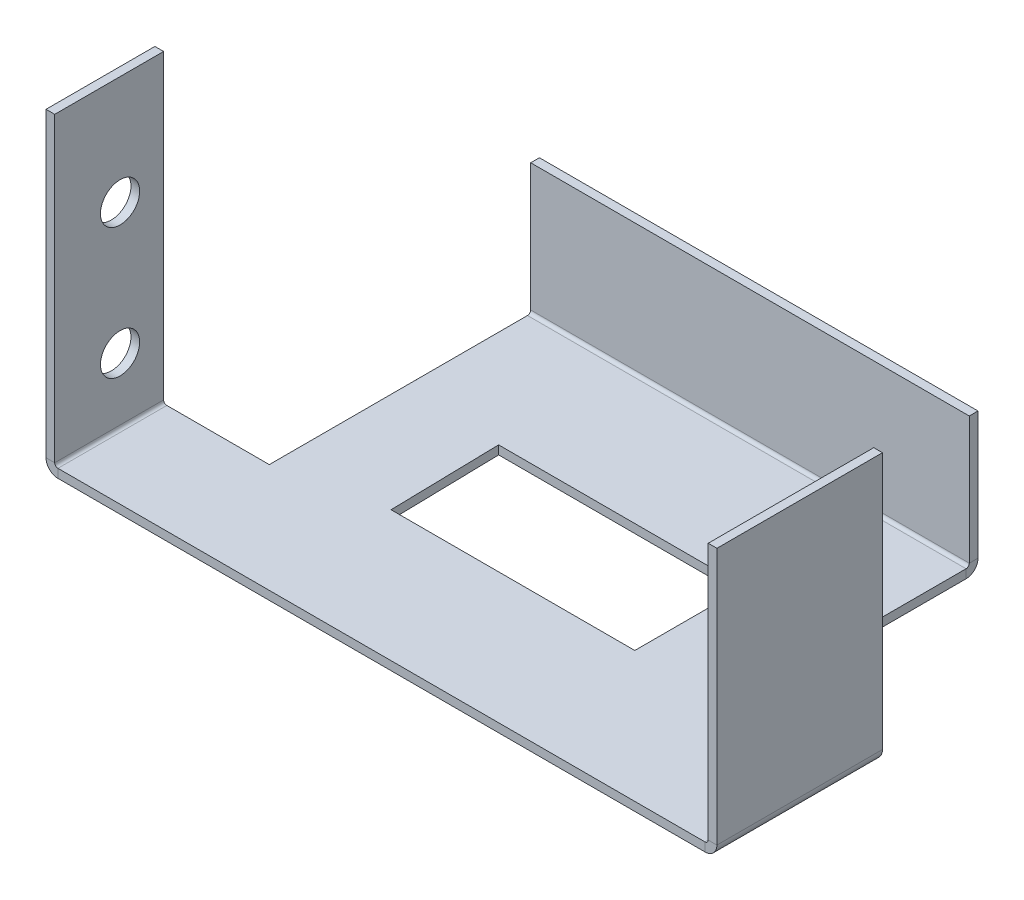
ISO-10303-21;
HEADER;
FILE_DESCRIPTION(('STEP AP214'),'2;1');
FILE_NAME('part.step','',(''),(''),'','','');
FILE_SCHEMA(('AUTOMOTIVE_DESIGN { 1 0 10303 214 1 1 1 1 }'));
ENDSEC;
DATA;
#1=APPLICATION_CONTEXT('core data for automotive mechanical design processes');
#2=APPLICATION_PROTOCOL_DEFINITION('international standard','automotive_design',2000,#1);
#3=PRODUCT_CONTEXT('',#1,'mechanical');
#4=PRODUCT('Part','Part','',(#3));
#5=PRODUCT_RELATED_PRODUCT_CATEGORY('part','',(#4));
#6=PRODUCT_DEFINITION_FORMATION('','',#4);
#7=PRODUCT_DEFINITION_CONTEXT('part definition',#1,'design');
#8=PRODUCT_DEFINITION('design','',#6,#7);
#9=PRODUCT_DEFINITION_SHAPE('','',#8);
#10=(LENGTH_UNIT() NAMED_UNIT(*) SI_UNIT(.MILLI.,.METRE.));
#11=(NAMED_UNIT(*) PLANE_ANGLE_UNIT() SI_UNIT($,.RADIAN.));
#12=(NAMED_UNIT(*) SI_UNIT($,.STERADIAN.) SOLID_ANGLE_UNIT());
#13=UNCERTAINTY_MEASURE_WITH_UNIT(LENGTH_MEASURE(1.E-05),#10,'distance_accuracy_value','');
#14=(GEOMETRIC_REPRESENTATION_CONTEXT(3) GLOBAL_UNCERTAINTY_ASSIGNED_CONTEXT((#13)) GLOBAL_UNIT_ASSIGNED_CONTEXT((#10,
#11,#12)) REPRESENTATION_CONTEXT('',''));
#15=CARTESIAN_POINT('',(0.,0.,0.));
#16=DIRECTION('',(0.,0.,1.));
#17=DIRECTION('',(1.,0.,0.));
#18=AXIS2_PLACEMENT_3D('',#15,#16,#17);
#19=CARTESIAN_POINT('',(-75.5051328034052,-2.,0.));
#20=DIRECTION('',(0.,1.,0.));
#21=DIRECTION('',(0.,0.,1.));
#22=AXIS2_PLACEMENT_3D('',#19,#20,#21);
#23=PLANE('',#22);
#24=DIRECTION('',(-1.,0.,0.));
#25=VECTOR('',#24,1.);
#26=CARTESIAN_POINT('',(-75.5051328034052,-2.,-55.2404705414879));
#27=LINE('',#26,#25);
#28=CARTESIAN_POINT('',(27.647227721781,-2.,-55.2404705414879));
#29=VERTEX_POINT('',#28);
#30=CARTESIAN_POINT('',(-28.8507209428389,-2.,-55.2404705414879));
#31=VERTEX_POINT('',#30);
#32=EDGE_CURVE('E227',#29,#31,#27,.T.);
#33=ORIENTED_EDGE('',*,*,#32,.T.);
#34=DIRECTION('',(0.0216638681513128,0.,0.999765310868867));
#35=VECTOR('',#34,1.);
#36=CARTESIAN_POINT('',(-27.6761755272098,-2.,-1.03640345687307));
#37=LINE('',#36,#35);
#38=CARTESIAN_POINT('',(-28.3037863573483,-2.,-30.));
#39=VERTEX_POINT('',#38);
#40=EDGE_CURVE('E230',#31,#39,#37,.T.);
#41=ORIENTED_EDGE('',*,*,#40,.T.);
#42=DIRECTION('',(1.,0.,0.));
#43=VECTOR('',#42,1.);
#44=CARTESIAN_POINT('',(-75.5051328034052,-2.,-30.));
#45=LINE('',#44,#43);
#46=CARTESIAN_POINT('',(27.647227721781,-2.,-30.));
#47=VERTEX_POINT('',#46);
#48=EDGE_CURVE('E222',#39,#47,#45,.T.);
#49=ORIENTED_EDGE('',*,*,#48,.T.);
#50=DIRECTION('',(0.,0.,-1.));
#51=VECTOR('',#50,1.);
#52=CARTESIAN_POINT('',(27.647227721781,-2.,0.));
#53=LINE('',#52,#51);
#54=EDGE_CURVE('E202',#47,#29,#53,.T.);
#55=ORIENTED_EDGE('',*,*,#54,.T.);
#56=EDGE_LOOP('',(#33,#41,#49,#55));
#57=FACE_BOUND('',#56,.T.);
#58=DIRECTION('',(0.,0.,1.));
#59=VECTOR('',#58,1.);
#60=CARTESIAN_POINT('',(-74.7685328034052,-2.,0.));
#61=LINE('',#60,#59);
#62=CARTESIAN_POINT('',(-74.7685328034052,-2.,0.));
#63=VERTEX_POINT('',#62);
#64=CARTESIAN_POINT('',(-74.7685328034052,-2.,-25.));
#65=VERTEX_POINT('',#64);
#66=EDGE_CURVE('E276',#63,#65,#61,.F.);
#67=ORIENTED_EDGE('',*,*,#66,.T.);
#68=DIRECTION('',(-1.,0.,0.));
#69=VECTOR('',#68,1.);
#70=CARTESIAN_POINT('',(-51.2495979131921,-2.,-25.));
#71=LINE('',#70,#69);
#72=CARTESIAN_POINT('',(-51.2495979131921,-2.,-25.));
#73=VERTEX_POINT('',#72);
#74=EDGE_CURVE('E416',#73,#65,#71,.T.);
#75=ORIENTED_EDGE('',*,*,#74,.F.);
#76=DIRECTION('',(0.,0.,1.));
#77=VECTOR('',#76,1.);
#78=CARTESIAN_POINT('',(-51.2495979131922,-2.,-85.));
#79=LINE('',#78,#77);
#80=CARTESIAN_POINT('',(-51.2495979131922,-2.00000000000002,-84.2633999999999));
#81=VERTEX_POINT('',#80);
#82=EDGE_CURVE('E414',#81,#73,#79,.T.);
#83=ORIENTED_EDGE('',*,*,#82,.F.);
#84=DIRECTION('',(-1.,0.,0.));
#85=VECTOR('',#84,1.);
#86=CARTESIAN_POINT('',(-51.2495979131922,-2.00000000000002,-84.2633999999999));
#87=LINE('',#86,#85);
#88=CARTESIAN_POINT('',(49.4239124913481,-2.,-84.2634));
#89=VERTEX_POINT('',#88);
#90=EDGE_CURVE('E383',#81,#89,#87,.F.);
#91=ORIENTED_EDGE('',*,*,#90,.T.);
#92=DIRECTION('',(0.,0.,-1.));
#93=VECTOR('',#92,1.);
#94=CARTESIAN_POINT('',(49.4239124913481,-2.,-38.));
#95=LINE('',#94,#93);
#96=CARTESIAN_POINT('',(49.4239124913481,-2.,-38.));
#97=VERTEX_POINT('',#96);
#98=EDGE_CURVE('E411',#97,#89,#95,.T.);
#99=ORIENTED_EDGE('',*,*,#98,.F.);
#100=DIRECTION('',(-1.,0.,0.));
#101=VECTOR('',#100,1.);
#102=CARTESIAN_POINT('',(74.4948671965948,-2.,-38.));
#103=LINE('',#102,#101);
#104=CARTESIAN_POINT('',(73.7582671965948,-2.,-38.));
#105=VERTEX_POINT('',#104);
#106=EDGE_CURVE('E408',#105,#97,#103,.T.);
#107=ORIENTED_EDGE('',*,*,#106,.F.);
#108=DIRECTION('',(0.,0.,-1.));
#109=VECTOR('',#108,1.);
#110=CARTESIAN_POINT('',(73.7582671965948,-2.,-38.));
#111=LINE('',#110,#109);
#112=CARTESIAN_POINT('',(73.7582671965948,-2.,0.));
#113=VERTEX_POINT('',#112);
#114=EDGE_CURVE('E329',#105,#113,#111,.F.);
#115=ORIENTED_EDGE('',*,*,#114,.T.);
#116=DIRECTION('',(1.,0.,0.));
#117=VECTOR('',#116,1.);
#118=CARTESIAN_POINT('',(-75.5051328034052,-2.,0.));
#119=LINE('',#118,#117);
#120=EDGE_CURVE('E406',#63,#113,#119,.T.);
#121=ORIENTED_EDGE('',*,*,#120,.F.);
#122=EDGE_LOOP('',(#67,#75,#83,#91,#99,#107,#115,#121));
#123=FACE_BOUND('',#122,.T.);
#124=ADVANCED_FACE('F35',(#57,#123),#23,.F.);
#125=CARTESIAN_POINT('',(-75.5051328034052,0.,0.));
#126=DIRECTION('',(0.,1.,0.));
#127=DIRECTION('',(0.,0.,1.));
#128=AXIS2_PLACEMENT_3D('',#125,#126,#127);
#129=PLANE('',#128);
#130=DIRECTION('',(0.0216638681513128,0.,0.999765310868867));
#131=VECTOR('',#130,1.);
#132=CARTESIAN_POINT('',(-28.8507209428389,0.,-55.2404705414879));
#133=LINE('',#132,#131);
#134=CARTESIAN_POINT('',(-28.8507209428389,0.,-55.2404705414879));
#135=VERTEX_POINT('',#134);
#136=CARTESIAN_POINT('',(-28.3037863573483,0.,-30.));
#137=VERTEX_POINT('',#136);
#138=EDGE_CURVE('E58',#135,#137,#133,.T.);
#139=ORIENTED_EDGE('',*,*,#138,.F.);
#140=DIRECTION('',(-1.,0.,0.));
#141=VECTOR('',#140,1.);
#142=CARTESIAN_POINT('',(-28.8507209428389,0.,-55.2404705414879));
#143=LINE('',#142,#141);
#144=CARTESIAN_POINT('',(27.647227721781,0.,-55.2404705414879));
#145=VERTEX_POINT('',#144);
#146=EDGE_CURVE('E215',#145,#135,#143,.T.);
#147=ORIENTED_EDGE('',*,*,#146,.F.);
#148=DIRECTION('',(0.,0.,-1.));
#149=VECTOR('',#148,1.);
#150=CARTESIAN_POINT('',(27.647227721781,0.,-55.2404705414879));
#151=LINE('',#150,#149);
#152=CARTESIAN_POINT('',(27.647227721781,0.,-30.));
#153=VERTEX_POINT('',#152);
#154=EDGE_CURVE('E199',#153,#145,#151,.T.);
#155=ORIENTED_EDGE('',*,*,#154,.F.);
#156=DIRECTION('',(1.,0.,0.));
#157=VECTOR('',#156,1.);
#158=CARTESIAN_POINT('',(-28.3037863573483,0.,-30.));
#159=LINE('',#158,#157);
#160=EDGE_CURVE('E208',#137,#153,#159,.T.);
#161=ORIENTED_EDGE('',*,*,#160,.F.);
#162=EDGE_LOOP('',(#139,#147,#155,#161));
#163=FACE_BOUND('',#162,.T.);
#164=DIRECTION('',(-1.,0.,0.));
#165=VECTOR('',#164,1.);
#166=CARTESIAN_POINT('',(-51.2495979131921,0.,-25.));
#167=LINE('',#166,#165);
#168=CARTESIAN_POINT('',(-51.2495979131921,0.,-25.));
#169=VERTEX_POINT('',#168);
#170=CARTESIAN_POINT('',(-74.7685328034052,0.,-25.));
#171=VERTEX_POINT('',#170);
#172=EDGE_CURVE('E409',#169,#171,#167,.T.);
#173=ORIENTED_EDGE('',*,*,#172,.T.);
#174=DIRECTION('',(0.,0.,1.));
#175=VECTOR('',#174,1.);
#176=CARTESIAN_POINT('',(-74.7685328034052,0.,0.));
#177=LINE('',#176,#175);
#178=CARTESIAN_POINT('',(-74.7685328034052,0.,0.));
#179=VERTEX_POINT('',#178);
#180=EDGE_CURVE('E288',#179,#171,#177,.F.);
#181=ORIENTED_EDGE('',*,*,#180,.F.);
#182=DIRECTION('',(1.,0.,0.));
#183=VECTOR('',#182,1.);
#184=CARTESIAN_POINT('',(-75.5051328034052,0.,0.));
#185=LINE('',#184,#183);
#186=CARTESIAN_POINT('',(73.7582671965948,0.,0.));
#187=VERTEX_POINT('',#186);
#188=EDGE_CURVE('E403',#179,#187,#185,.T.);
#189=ORIENTED_EDGE('',*,*,#188,.T.);
#190=DIRECTION('',(0.,0.,-1.));
#191=VECTOR('',#190,1.);
#192=CARTESIAN_POINT('',(73.7582671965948,0.,-38.));
#193=LINE('',#192,#191);
#194=CARTESIAN_POINT('',(73.7582671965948,0.,-38.));
#195=VERTEX_POINT('',#194);
#196=EDGE_CURVE('E342',#195,#187,#193,.F.);
#197=ORIENTED_EDGE('',*,*,#196,.F.);
#198=DIRECTION('',(-1.,0.,0.));
#199=VECTOR('',#198,1.);
#200=CARTESIAN_POINT('',(74.4948671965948,0.,-38.));
#201=LINE('',#200,#199);
#202=CARTESIAN_POINT('',(49.4239124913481,0.,-38.));
#203=VERTEX_POINT('',#202);
#204=EDGE_CURVE('E420',#195,#203,#201,.T.);
#205=ORIENTED_EDGE('',*,*,#204,.T.);
#206=DIRECTION('',(0.,0.,-1.));
#207=VECTOR('',#206,1.);
#208=CARTESIAN_POINT('',(49.4239124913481,0.,-38.));
#209=LINE('',#208,#207);
#210=CARTESIAN_POINT('',(49.4239124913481,0.,-84.2634));
#211=VERTEX_POINT('',#210);
#212=EDGE_CURVE('E422',#203,#211,#209,.T.);
#213=ORIENTED_EDGE('',*,*,#212,.T.);
#214=DIRECTION('',(-1.,0.,0.));
#215=VECTOR('',#214,1.);
#216=CARTESIAN_POINT('',(-51.2495979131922,0.,-84.2634));
#217=LINE('',#216,#215);
#218=CARTESIAN_POINT('',(-51.2495979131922,0.,-84.2634));
#219=VERTEX_POINT('',#218);
#220=EDGE_CURVE('E395',#219,#211,#217,.F.);
#221=ORIENTED_EDGE('',*,*,#220,.F.);
#222=DIRECTION('',(0.,0.,1.));
#223=VECTOR('',#222,1.);
#224=CARTESIAN_POINT('',(-51.2495979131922,0.,-85.));
#225=LINE('',#224,#223);
#226=EDGE_CURVE('E425',#219,#169,#225,.T.);
#227=ORIENTED_EDGE('',*,*,#226,.T.);
#228=EDGE_LOOP('',(#173,#181,#189,#197,#205,#213,#221,#227));
#229=FACE_BOUND('',#228,.T.);
#230=ADVANCED_FACE('F212',(#163,#229),#129,.T.);
#231=CARTESIAN_POINT('',(-75.5051328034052,-2.,0.));
#232=DIRECTION('',(0.,0.,1.));
#233=DIRECTION('',(1.,0.,0.));
#234=AXIS2_PLACEMENT_3D('',#231,#232,#233);
#235=PLANE('',#234);
#236=ORIENTED_EDGE('',*,*,#188,.F.);
#237=DIRECTION('',(0.,-1.,0.));
#238=VECTOR('',#237,1.);
#239=CARTESIAN_POINT('',(-74.7685328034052,0.,0.));
#240=LINE('',#239,#238);
#241=EDGE_CURVE('E282',#179,#63,#240,.T.);
#242=ORIENTED_EDGE('',*,*,#241,.T.);
#243=ORIENTED_EDGE('',*,*,#120,.T.);
#244=DIRECTION('',(0.,-1.,0.));
#245=VECTOR('',#244,1.);
#246=CARTESIAN_POINT('',(73.7582671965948,0.,0.));
#247=LINE('',#246,#245);
#248=EDGE_CURVE('E347',#187,#113,#247,.T.);
#249=ORIENTED_EDGE('',*,*,#248,.F.);
#250=EDGE_LOOP('',(#236,#242,#243,#249));
#251=FACE_BOUND('',#250,.T.);
#252=ADVANCED_FACE('F37',(#251),#235,.T.);
#253=CARTESIAN_POINT('',(74.4948671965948,-2.,-38.));
#254=DIRECTION('',(0.,0.,-1.));
#255=DIRECTION('',(-1.,0.,0.));
#256=AXIS2_PLACEMENT_3D('',#253,#254,#255);
#257=PLANE('',#256);
#258=ORIENTED_EDGE('',*,*,#204,.F.);
#259=DIRECTION('',(0.,-1.,0.));
#260=VECTOR('',#259,1.);
#261=CARTESIAN_POINT('',(73.7582671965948,0.,-38.));
#262=LINE('',#261,#260);
#263=EDGE_CURVE('E336',#195,#105,#262,.T.);
#264=ORIENTED_EDGE('',*,*,#263,.T.);
#265=ORIENTED_EDGE('',*,*,#106,.T.);
#266=DIRECTION('',(0.,1.,0.));
#267=VECTOR('',#266,1.);
#268=CARTESIAN_POINT('',(49.4239124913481,-2.,-38.));
#269=LINE('',#268,#267);
#270=EDGE_CURVE('E39',#97,#203,#269,.T.);
#271=ORIENTED_EDGE('',*,*,#270,.T.);
#272=EDGE_LOOP('',(#258,#264,#265,#271));
#273=FACE_BOUND('',#272,.T.);
#274=ADVANCED_FACE('F493',(#273),#257,.T.);
#275=CARTESIAN_POINT('',(-51.2495979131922,-2.,-85.));
#276=DIRECTION('',(-1.,0.,0.));
#277=DIRECTION('',(0.,0.,1.));
#278=AXIS2_PLACEMENT_3D('',#275,#276,#277);
#279=PLANE('',#278);
#280=ORIENTED_EDGE('',*,*,#226,.F.);
#281=DIRECTION('',(0.,-1.,0.));
#282=VECTOR('',#281,1.);
#283=CARTESIAN_POINT('',(-51.2495979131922,0.,-84.2634));
#284=LINE('',#283,#282);
#285=EDGE_CURVE('E389',#219,#81,#284,.T.);
#286=ORIENTED_EDGE('',*,*,#285,.T.);
#287=ORIENTED_EDGE('',*,*,#82,.T.);
#288=DIRECTION('',(0.,1.,0.));
#289=VECTOR('',#288,1.);
#290=CARTESIAN_POINT('',(-51.2495979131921,-2.,-25.));
#291=LINE('',#290,#289);
#292=EDGE_CURVE('E11',#73,#169,#291,.T.);
#293=ORIENTED_EDGE('',*,*,#292,.T.);
#294=EDGE_LOOP('',(#280,#286,#287,#293));
#295=FACE_BOUND('',#294,.T.);
#296=ADVANCED_FACE('F490',(#295),#279,.T.);
#297=CARTESIAN_POINT('',(-51.2495979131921,-2.,-25.));
#298=DIRECTION('',(0.,0.,-1.));
#299=DIRECTION('',(-1.,0.,0.));
#300=AXIS2_PLACEMENT_3D('',#297,#298,#299);
#301=PLANE('',#300);
#302=DIRECTION('',(0.,-1.,0.));
#303=VECTOR('',#302,1.);
#304=CARTESIAN_POINT('',(-74.7685328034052,0.,-25.));
#305=LINE('',#304,#303);
#306=EDGE_CURVE('E293',#171,#65,#305,.T.);
#307=ORIENTED_EDGE('',*,*,#306,.F.);
#308=ORIENTED_EDGE('',*,*,#172,.F.);
#309=ORIENTED_EDGE('',*,*,#292,.F.);
#310=ORIENTED_EDGE('',*,*,#74,.T.);
#311=EDGE_LOOP('',(#307,#308,#309,#310));
#312=FACE_BOUND('',#311,.T.);
#313=ADVANCED_FACE('F486',(#312),#301,.T.);
#314=CARTESIAN_POINT('',(49.4239124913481,-2.,-38.));
#315=DIRECTION('',(1.,0.,0.));
#316=DIRECTION('',(0.,0.,-1.));
#317=AXIS2_PLACEMENT_3D('',#314,#315,#316);
#318=PLANE('',#317);
#319=DIRECTION('',(0.,-1.,0.));
#320=VECTOR('',#319,1.);
#321=CARTESIAN_POINT('',(49.4239124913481,0.,-84.2634));
#322=LINE('',#321,#320);
#323=EDGE_CURVE('E400',#211,#89,#322,.T.);
#324=ORIENTED_EDGE('',*,*,#323,.F.);
#325=ORIENTED_EDGE('',*,*,#212,.F.);
#326=ORIENTED_EDGE('',*,*,#270,.F.);
#327=ORIENTED_EDGE('',*,*,#98,.T.);
#328=EDGE_LOOP('',(#324,#325,#326,#327));
#329=FACE_BOUND('',#328,.T.);
#330=ADVANCED_FACE('F489',(#329),#318,.T.);
#331=CARTESIAN_POINT('',(49.4239124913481,0.736599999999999,-84.2634));
#332=DIRECTION('',(1.,0.,0.));
#333=DIRECTION('',(0.,0.,-1.));
#334=AXIS2_PLACEMENT_3D('',#331,#332,#333);
#335=PLANE('',#334);
#336=DIRECTION('',(0.,0.,-1.));
#337=VECTOR('',#336,1.);
#338=CARTESIAN_POINT('',(49.4239124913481,0.736600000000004,-85.));
#339=LINE('',#338,#337);
#340=CARTESIAN_POINT('',(49.4239124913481,0.736599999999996,-85.));
#341=VERTEX_POINT('',#340);
#342=CARTESIAN_POINT('',(49.4239124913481,0.736599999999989,-87.));
#343=VERTEX_POINT('',#342);
#344=EDGE_CURVE('E350',#341,#343,#339,.T.);
#345=ORIENTED_EDGE('',*,*,#344,.F.);
#346=CARTESIAN_POINT('',(49.4239124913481,0.736599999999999,-84.2634));
#347=DIRECTION('',(-1.,0.,0.));
#348=DIRECTION('',(0.,0.,1.));
#349=AXIS2_PLACEMENT_3D('',#346,#347,#348);
#350=CIRCLE('',#349,0.736600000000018);
#351=EDGE_CURVE('E392',#211,#341,#350,.F.);
#352=ORIENTED_EDGE('',*,*,#351,.F.);
#353=ORIENTED_EDGE('',*,*,#323,.T.);
#354=CARTESIAN_POINT('',(49.4239124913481,0.736599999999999,-84.2634));
#355=DIRECTION('',(-1.,0.,0.));
#356=DIRECTION('',(0.,0.,1.));
#357=AXIS2_PLACEMENT_3D('',#354,#355,#356);
#358=CIRCLE('',#357,2.73660000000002);
#359=EDGE_CURVE('E385',#89,#343,#358,.F.);
#360=ORIENTED_EDGE('',*,*,#359,.T.);
#361=EDGE_LOOP('',(#345,#352,#353,#360));
#362=FACE_BOUND('',#361,.T.);
#363=ADVANCED_FACE('F496',(#362),#335,.T.);
#364=CARTESIAN_POINT('',(-51.2495979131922,0.736599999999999,-84.2634));
#365=DIRECTION('',(1.,0.,0.));
#366=DIRECTION('',(0.,0.,-1.));
#367=AXIS2_PLACEMENT_3D('',#364,#365,#366);
#368=PLANE('',#367);
#369=CARTESIAN_POINT('',(-51.2495979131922,0.736599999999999,-84.2634));
#370=DIRECTION('',(-1.,0.,0.));
#371=DIRECTION('',(0.,0.,1.));
#372=AXIS2_PLACEMENT_3D('',#369,#370,#371);
#373=CIRCLE('',#372,0.736600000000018);
#374=CARTESIAN_POINT('',(-51.2495979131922,0.736599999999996,-85.));
#375=VERTEX_POINT('',#374);
#376=EDGE_CURVE('E382',#375,#219,#373,.T.);
#377=ORIENTED_EDGE('',*,*,#376,.F.);
#378=DIRECTION('',(0.,0.,-1.));
#379=VECTOR('',#378,1.);
#380=CARTESIAN_POINT('',(-51.2495979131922,0.736600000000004,-85.));
#381=LINE('',#380,#379);
#382=CARTESIAN_POINT('',(-51.2495979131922,0.736600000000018,-87.));
#383=VERTEX_POINT('',#382);
#384=EDGE_CURVE('E355',#375,#383,#381,.T.);
#385=ORIENTED_EDGE('',*,*,#384,.T.);
#386=CARTESIAN_POINT('',(-51.2495979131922,0.736599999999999,-84.2634));
#387=DIRECTION('',(-1.,0.,0.));
#388=DIRECTION('',(0.,0.,1.));
#389=AXIS2_PLACEMENT_3D('',#386,#387,#388);
#390=CIRCLE('',#389,2.73660000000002);
#391=EDGE_CURVE('E386',#383,#81,#390,.T.);
#392=ORIENTED_EDGE('',*,*,#391,.T.);
#393=ORIENTED_EDGE('',*,*,#285,.F.);
#394=EDGE_LOOP('',(#377,#385,#392,#393));
#395=FACE_BOUND('',#394,.T.);
#396=ADVANCED_FACE('F483',(#395),#368,.F.);
#397=CARTESIAN_POINT('',(-51.2495979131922,0.736599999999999,-84.2634));
#398=DIRECTION('',(-1.,0.,0.));
#399=DIRECTION('',(0.,0.,-1.));
#400=AXIS2_PLACEMENT_3D('',#397,#398,#399);
#401=CYLINDRICAL_SURFACE('',#400,2.73660000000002);
#402=ORIENTED_EDGE('',*,*,#90,.F.);
#403=ORIENTED_EDGE('',*,*,#391,.F.);
#404=DIRECTION('',(1.,0.,0.));
#405=VECTOR('',#404,1.);
#406=CARTESIAN_POINT('',(-51.2495979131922,0.736600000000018,-87.));
#407=LINE('',#406,#405);
#408=EDGE_CURVE('E358',#383,#343,#407,.T.);
#409=ORIENTED_EDGE('',*,*,#408,.T.);
#410=ORIENTED_EDGE('',*,*,#359,.F.);
#411=EDGE_LOOP('',(#402,#403,#409,#410));
#412=FACE_BOUND('',#411,.T.);
#413=ADVANCED_FACE('F581',(#412),#401,.T.);
#414=CARTESIAN_POINT('',(-51.2495979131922,0.736599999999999,-84.2634));
#415=DIRECTION('',(-1.,0.,0.));
#416=DIRECTION('',(0.,0.,-1.));
#417=AXIS2_PLACEMENT_3D('',#414,#415,#416);
#418=CYLINDRICAL_SURFACE('',#417,0.736600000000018);
#419=ORIENTED_EDGE('',*,*,#220,.T.);
#420=ORIENTED_EDGE('',*,*,#351,.T.);
#421=DIRECTION('',(-1.,0.,0.));
#422=VECTOR('',#421,1.);
#423=CARTESIAN_POINT('',(49.4239124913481,0.736600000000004,-85.));
#424=LINE('',#423,#422);
#425=EDGE_CURVE('E353',#341,#375,#424,.T.);
#426=ORIENTED_EDGE('',*,*,#425,.T.);
#427=ORIENTED_EDGE('',*,*,#376,.T.);
#428=EDGE_LOOP('',(#419,#420,#426,#427));
#429=FACE_BOUND('',#428,.T.);
#430=ADVANCED_FACE('F547',(#429),#418,.F.);
#431=CARTESIAN_POINT('',(-51.2495979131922,30.,-87.0000000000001));
#432=DIRECTION('',(1.,0.,0.));
#433=DIRECTION('',(0.,0.,-1.));
#434=AXIS2_PLACEMENT_3D('',#431,#432,#433);
#435=PLANE('',#434);
#436=ORIENTED_EDGE('',*,*,#384,.F.);
#437=DIRECTION('',(0.,1.,0.));
#438=VECTOR('',#437,1.);
#439=CARTESIAN_POINT('',(-51.2495979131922,30.,-85.0000000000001));
#440=LINE('',#439,#438);
#441=CARTESIAN_POINT('',(-51.2495979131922,30.,-85.0000000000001));
#442=VERTEX_POINT('',#441);
#443=EDGE_CURVE('E362',#375,#442,#440,.T.);
#444=ORIENTED_EDGE('',*,*,#443,.T.);
#445=DIRECTION('',(0.,0.,1.));
#446=VECTOR('',#445,1.);
#447=CARTESIAN_POINT('',(-51.2495979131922,30.,-87.0000000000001));
#448=LINE('',#447,#446);
#449=CARTESIAN_POINT('',(-51.2495979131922,30.,-87.0000000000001));
#450=VERTEX_POINT('',#449);
#451=EDGE_CURVE('E379',#450,#442,#448,.T.);
#452=ORIENTED_EDGE('',*,*,#451,.F.);
#453=DIRECTION('',(0.,1.,0.));
#454=VECTOR('',#453,1.);
#455=CARTESIAN_POINT('',(-51.2495979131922,30.,-87.0000000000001));
#456=LINE('',#455,#454);
#457=EDGE_CURVE('E363',#383,#450,#456,.T.);
#458=ORIENTED_EDGE('',*,*,#457,.F.);
#459=EDGE_LOOP('',(#436,#444,#452,#458));
#460=FACE_BOUND('',#459,.T.);
#461=ADVANCED_FACE('F573',(#460),#435,.F.);
#462=CARTESIAN_POINT('',(49.4239124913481,0.,-87.));
#463=DIRECTION('',(-1.,0.,0.));
#464=DIRECTION('',(0.,-1.,0.));
#465=AXIS2_PLACEMENT_3D('',#462,#463,#464);
#466=PLANE('',#465);
#467=ORIENTED_EDGE('',*,*,#344,.T.);
#468=DIRECTION('',(0.,-1.,0.));
#469=VECTOR('',#468,1.);
#470=CARTESIAN_POINT('',(49.4239124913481,0.,-87.));
#471=LINE('',#470,#469);
#472=CARTESIAN_POINT('',(49.4239124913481,30.,-87.0000000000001));
#473=VERTEX_POINT('',#472);
#474=EDGE_CURVE('E368',#473,#343,#471,.T.);
#475=ORIENTED_EDGE('',*,*,#474,.F.);
#476=DIRECTION('',(0.,0.,1.));
#477=VECTOR('',#476,1.);
#478=CARTESIAN_POINT('',(49.4239124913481,30.,-87.0000000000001));
#479=LINE('',#478,#477);
#480=CARTESIAN_POINT('',(49.4239124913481,30.,-85.0000000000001));
#481=VERTEX_POINT('',#480);
#482=EDGE_CURVE('E371',#473,#481,#479,.T.);
#483=ORIENTED_EDGE('',*,*,#482,.T.);
#484=DIRECTION('',(0.,-1.,0.));
#485=VECTOR('',#484,1.);
#486=CARTESIAN_POINT('',(49.4239124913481,0.,-85.));
#487=LINE('',#486,#485);
#488=EDGE_CURVE('E366',#481,#341,#487,.T.);
#489=ORIENTED_EDGE('',*,*,#488,.T.);
#490=EDGE_LOOP('',(#467,#475,#483,#489));
#491=FACE_BOUND('',#490,.T.);
#492=ADVANCED_FACE('F554',(#491),#466,.F.);
#493=CARTESIAN_POINT('',(-51.2495979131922,0.,-87.));
#494=DIRECTION('',(0.,0.,1.));
#495=DIRECTION('',(0.,-1.,0.));
#496=AXIS2_PLACEMENT_3D('',#493,#494,#495);
#497=PLANE('',#496);
#498=ORIENTED_EDGE('',*,*,#408,.F.);
#499=ORIENTED_EDGE('',*,*,#457,.T.);
#500=DIRECTION('',(1.,0.,0.));
#501=VECTOR('',#500,1.);
#502=CARTESIAN_POINT('',(49.4239124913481,30.,-87.0000000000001));
#503=LINE('',#502,#501);
#504=EDGE_CURVE('E365',#450,#473,#503,.T.);
#505=ORIENTED_EDGE('',*,*,#504,.T.);
#506=ORIENTED_EDGE('',*,*,#474,.T.);
#507=EDGE_LOOP('',(#498,#499,#505,#506));
#508=FACE_BOUND('',#507,.T.);
#509=ADVANCED_FACE('F558',(#508),#497,.F.);
#510=CARTESIAN_POINT('',(-51.2495979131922,0.,-85.));
#511=DIRECTION('',(0.,0.,1.));
#512=DIRECTION('',(0.,-1.,0.));
#513=AXIS2_PLACEMENT_3D('',#510,#511,#512);
#514=PLANE('',#513);
#515=ORIENTED_EDGE('',*,*,#443,.F.);
#516=ORIENTED_EDGE('',*,*,#425,.F.);
#517=ORIENTED_EDGE('',*,*,#488,.F.);
#518=DIRECTION('',(1.,0.,0.));
#519=VECTOR('',#518,1.);
#520=CARTESIAN_POINT('',(49.4239124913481,30.,-85.0000000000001));
#521=LINE('',#520,#519);
#522=EDGE_CURVE('E373',#442,#481,#521,.T.);
#523=ORIENTED_EDGE('',*,*,#522,.F.);
#524=EDGE_LOOP('',(#515,#516,#517,#523));
#525=FACE_BOUND('',#524,.T.);
#526=ADVANCED_FACE('F568',(#525),#514,.T.);
#527=CARTESIAN_POINT('',(49.4239124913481,30.,-87.0000000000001));
#528=DIRECTION('',(0.,-1.,0.));
#529=DIRECTION('',(0.,0.,-1.));
#530=AXIS2_PLACEMENT_3D('',#527,#528,#529);
#531=PLANE('',#530);
#532=ORIENTED_EDGE('',*,*,#522,.T.);
#533=ORIENTED_EDGE('',*,*,#482,.F.);
#534=ORIENTED_EDGE('',*,*,#504,.F.);
#535=ORIENTED_EDGE('',*,*,#451,.T.);
#536=EDGE_LOOP('',(#532,#533,#534,#535));
#537=FACE_BOUND('',#536,.T.);
#538=ADVANCED_FACE('F564',(#537),#531,.F.);
#539=CARTESIAN_POINT('',(73.7582671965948,0.736600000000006,0.));
#540=DIRECTION('',(0.,0.,1.));
#541=DIRECTION('',(1.,0.,0.));
#542=AXIS2_PLACEMENT_3D('',#539,#540,#541);
#543=PLANE('',#542);
#544=DIRECTION('',(1.,0.,0.));
#545=VECTOR('',#544,1.);
#546=CARTESIAN_POINT('',(74.4948671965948,0.736600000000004,0.));
#547=LINE('',#546,#545);
#548=CARTESIAN_POINT('',(74.4948671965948,0.736600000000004,0.));
#549=VERTEX_POINT('',#548);
#550=CARTESIAN_POINT('',(76.4948671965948,0.736599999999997,0.));
#551=VERTEX_POINT('',#550);
#552=EDGE_CURVE('E296',#549,#551,#547,.T.);
#553=ORIENTED_EDGE('',*,*,#552,.F.);
#554=CARTESIAN_POINT('',(73.7582671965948,0.736600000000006,0.));
#555=DIRECTION('',(0.,0.,-1.));
#556=DIRECTION('',(-1.,0.,0.));
#557=AXIS2_PLACEMENT_3D('',#554,#555,#556);
#558=CIRCLE('',#557,0.736600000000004);
#559=EDGE_CURVE('E339',#187,#549,#558,.F.);
#560=ORIENTED_EDGE('',*,*,#559,.F.);
#561=ORIENTED_EDGE('',*,*,#248,.T.);
#562=CARTESIAN_POINT('',(73.7582671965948,0.736600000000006,0.));
#563=DIRECTION('',(0.,0.,-1.));
#564=DIRECTION('',(-1.,0.,0.));
#565=AXIS2_PLACEMENT_3D('',#562,#563,#564);
#566=CIRCLE('',#565,2.7366);
#567=EDGE_CURVE('E332',#113,#551,#566,.F.);
#568=ORIENTED_EDGE('',*,*,#567,.T.);
#569=EDGE_LOOP('',(#553,#560,#561,#568));
#570=FACE_BOUND('',#569,.T.);
#571=ADVANCED_FACE('F541',(#570),#543,.T.);
#572=CARTESIAN_POINT('',(73.7582671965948,0.736600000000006,-38.));
#573=DIRECTION('',(0.,0.,1.));
#574=DIRECTION('',(1.,0.,0.));
#575=AXIS2_PLACEMENT_3D('',#572,#573,#574);
#576=PLANE('',#575);
#577=CARTESIAN_POINT('',(73.7582671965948,0.736600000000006,-38.));
#578=DIRECTION('',(0.,0.,-1.));
#579=DIRECTION('',(-1.,0.,0.));
#580=AXIS2_PLACEMENT_3D('',#577,#578,#579);
#581=CIRCLE('',#580,0.736600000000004);
#582=CARTESIAN_POINT('',(74.4948671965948,0.736600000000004,-38.));
#583=VERTEX_POINT('',#582);
#584=EDGE_CURVE('E328',#583,#195,#581,.T.);
#585=ORIENTED_EDGE('',*,*,#584,.F.);
#586=DIRECTION('',(1.,0.,0.));
#587=VECTOR('',#586,1.);
#588=CARTESIAN_POINT('',(74.4948671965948,0.736600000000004,-38.));
#589=LINE('',#588,#587);
#590=CARTESIAN_POINT('',(76.4948671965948,0.736599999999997,-38.));
#591=VERTEX_POINT('',#590);
#592=EDGE_CURVE('E301',#583,#591,#589,.T.);
#593=ORIENTED_EDGE('',*,*,#592,.T.);
#594=CARTESIAN_POINT('',(73.7582671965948,0.736600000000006,-38.));
#595=DIRECTION('',(0.,0.,-1.));
#596=DIRECTION('',(-1.,0.,0.));
#597=AXIS2_PLACEMENT_3D('',#594,#595,#596);
#598=CIRCLE('',#597,2.7366);
#599=EDGE_CURVE('E333',#591,#105,#598,.T.);
#600=ORIENTED_EDGE('',*,*,#599,.T.);
#601=ORIENTED_EDGE('',*,*,#263,.F.);
#602=EDGE_LOOP('',(#585,#593,#600,#601));
#603=FACE_BOUND('',#602,.T.);
#604=ADVANCED_FACE('F512',(#603),#576,.F.);
#605=CARTESIAN_POINT('',(73.7582671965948,0.736600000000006,-38.));
#606=DIRECTION('',(0.,0.,-1.));
#607=DIRECTION('',(1.,0.,0.));
#608=AXIS2_PLACEMENT_3D('',#605,#606,#607);
#609=CYLINDRICAL_SURFACE('',#608,2.7366);
#610=ORIENTED_EDGE('',*,*,#114,.F.);
#611=ORIENTED_EDGE('',*,*,#599,.F.);
#612=DIRECTION('',(0.,0.,1.));
#613=VECTOR('',#612,1.);
#614=CARTESIAN_POINT('',(76.4948671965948,0.736599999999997,0.));
#615=LINE('',#614,#613);
#616=EDGE_CURVE('E304',#591,#551,#615,.T.);
#617=ORIENTED_EDGE('',*,*,#616,.T.);
#618=ORIENTED_EDGE('',*,*,#567,.F.);
#619=EDGE_LOOP('',(#610,#611,#617,#618));
#620=FACE_BOUND('',#619,.T.);
#621=ADVANCED_FACE('F539',(#620),#609,.T.);
#622=CARTESIAN_POINT('',(73.7582671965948,0.736600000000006,-38.));
#623=DIRECTION('',(0.,0.,-1.));
#624=DIRECTION('',(1.,0.,0.));
#625=AXIS2_PLACEMENT_3D('',#622,#623,#624);
#626=CYLINDRICAL_SURFACE('',#625,0.736600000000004);
#627=ORIENTED_EDGE('',*,*,#196,.T.);
#628=ORIENTED_EDGE('',*,*,#559,.T.);
#629=DIRECTION('',(0.,0.,-1.));
#630=VECTOR('',#629,1.);
#631=CARTESIAN_POINT('',(74.4948671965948,0.736600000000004,0.));
#632=LINE('',#631,#630);
#633=EDGE_CURVE('E299',#549,#583,#632,.T.);
#634=ORIENTED_EDGE('',*,*,#633,.T.);
#635=ORIENTED_EDGE('',*,*,#584,.T.);
#636=EDGE_LOOP('',(#627,#628,#634,#635));
#637=FACE_BOUND('',#636,.T.);
#638=ADVANCED_FACE('F515',(#637),#626,.F.);
#639=CARTESIAN_POINT('',(76.4948671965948,0.,0.));
#640=DIRECTION('',(0.,0.,-1.));
#641=DIRECTION('',(-1.,0.,0.));
#642=AXIS2_PLACEMENT_3D('',#639,#640,#641);
#643=PLANE('',#642);
#644=ORIENTED_EDGE('',*,*,#552,.T.);
#645=DIRECTION('',(0.,-1.,0.));
#646=VECTOR('',#645,1.);
#647=CARTESIAN_POINT('',(76.4948671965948,0.,0.));
#648=LINE('',#647,#646);
#649=CARTESIAN_POINT('',(76.494867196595,59.7366,0.));
#650=VERTEX_POINT('',#649);
#651=EDGE_CURVE('E309',#650,#551,#648,.T.);
#652=ORIENTED_EDGE('',*,*,#651,.F.);
#653=DIRECTION('',(-1.,0.,0.));
#654=VECTOR('',#653,1.);
#655=CARTESIAN_POINT('',(76.494867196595,59.7366,0.));
#656=LINE('',#655,#654);
#657=CARTESIAN_POINT('',(74.494867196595,59.7366,0.));
#658=VERTEX_POINT('',#657);
#659=EDGE_CURVE('E317',#650,#658,#656,.T.);
#660=ORIENTED_EDGE('',*,*,#659,.T.);
#661=DIRECTION('',(0.,-1.,0.));
#662=VECTOR('',#661,1.);
#663=CARTESIAN_POINT('',(74.4948671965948,0.,0.));
#664=LINE('',#663,#662);
#665=EDGE_CURVE('E308',#658,#549,#664,.T.);
#666=ORIENTED_EDGE('',*,*,#665,.T.);
#667=EDGE_LOOP('',(#644,#652,#660,#666));
#668=FACE_BOUND('',#667,.T.);
#669=ADVANCED_FACE('F524',(#668),#643,.F.);
#670=CARTESIAN_POINT('',(76.494867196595,59.7366,-38.));
#671=DIRECTION('',(0.,0.,1.));
#672=DIRECTION('',(0.,-1.,0.));
#673=AXIS2_PLACEMENT_3D('',#670,#671,#672);
#674=PLANE('',#673);
#675=ORIENTED_EDGE('',*,*,#592,.F.);
#676=DIRECTION('',(0.,1.,0.));
#677=VECTOR('',#676,1.);
#678=CARTESIAN_POINT('',(74.494867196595,59.7366,-38.));
#679=LINE('',#678,#677);
#680=CARTESIAN_POINT('',(74.494867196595,59.7366,-38.));
#681=VERTEX_POINT('',#680);
#682=EDGE_CURVE('E320',#583,#681,#679,.T.);
#683=ORIENTED_EDGE('',*,*,#682,.T.);
#684=DIRECTION('',(-1.,0.,0.));
#685=VECTOR('',#684,1.);
#686=CARTESIAN_POINT('',(76.494867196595,59.7366,-38.));
#687=LINE('',#686,#685);
#688=CARTESIAN_POINT('',(76.494867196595,59.7366,-38.));
#689=VERTEX_POINT('',#688);
#690=EDGE_CURVE('E325',#689,#681,#687,.T.);
#691=ORIENTED_EDGE('',*,*,#690,.F.);
#692=DIRECTION('',(0.,1.,0.));
#693=VECTOR('',#692,1.);
#694=CARTESIAN_POINT('',(76.494867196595,59.7366,-38.));
#695=LINE('',#694,#693);
#696=EDGE_CURVE('E312',#591,#689,#695,.T.);
#697=ORIENTED_EDGE('',*,*,#696,.F.);
#698=EDGE_LOOP('',(#675,#683,#691,#697));
#699=FACE_BOUND('',#698,.T.);
#700=ADVANCED_FACE('F533',(#699),#674,.F.);
#701=CARTESIAN_POINT('',(76.494867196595,59.7366,0.));
#702=DIRECTION('',(-1.,0.,0.));
#703=DIRECTION('',(0.,-1.,0.));
#704=AXIS2_PLACEMENT_3D('',#701,#702,#703);
#705=PLANE('',#704);
#706=ORIENTED_EDGE('',*,*,#616,.F.);
#707=ORIENTED_EDGE('',*,*,#696,.T.);
#708=DIRECTION('',(0.,0.,1.));
#709=VECTOR('',#708,1.);
#710=CARTESIAN_POINT('',(76.494867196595,59.7366,0.));
#711=LINE('',#710,#709);
#712=EDGE_CURVE('E315',#689,#650,#711,.T.);
#713=ORIENTED_EDGE('',*,*,#712,.T.);
#714=ORIENTED_EDGE('',*,*,#651,.T.);
#715=EDGE_LOOP('',(#706,#707,#713,#714));
#716=FACE_BOUND('',#715,.T.);
#717=ADVANCED_FACE('F536',(#716),#705,.F.);
#718=CARTESIAN_POINT('',(74.494867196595,59.7366,0.));
#719=DIRECTION('',(-1.,0.,0.));
#720=DIRECTION('',(0.,-1.,0.));
#721=AXIS2_PLACEMENT_3D('',#718,#719,#720);
#722=PLANE('',#721);
#723=ORIENTED_EDGE('',*,*,#682,.F.);
#724=ORIENTED_EDGE('',*,*,#633,.F.);
#725=ORIENTED_EDGE('',*,*,#665,.F.);
#726=DIRECTION('',(0.,0.,1.));
#727=VECTOR('',#726,1.);
#728=CARTESIAN_POINT('',(74.494867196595,59.7366,0.));
#729=LINE('',#728,#727);
#730=EDGE_CURVE('E313',#681,#658,#729,.T.);
#731=ORIENTED_EDGE('',*,*,#730,.F.);
#732=EDGE_LOOP('',(#723,#724,#725,#731));
#733=FACE_BOUND('',#732,.T.);
#734=ADVANCED_FACE('F521',(#733),#722,.T.);
#735=CARTESIAN_POINT('',(76.494867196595,59.7366,0.));
#736=DIRECTION('',(0.,-1.,0.));
#737=DIRECTION('',(1.,0.,0.));
#738=AXIS2_PLACEMENT_3D('',#735,#736,#737);
#739=PLANE('',#738);
#740=ORIENTED_EDGE('',*,*,#730,.T.);
#741=ORIENTED_EDGE('',*,*,#659,.F.);
#742=ORIENTED_EDGE('',*,*,#712,.F.);
#743=ORIENTED_EDGE('',*,*,#690,.T.);
#744=EDGE_LOOP('',(#740,#741,#742,#743));
#745=FACE_BOUND('',#744,.T.);
#746=ADVANCED_FACE('F529',(#745),#739,.F.);
#747=CARTESIAN_POINT('',(-74.7685328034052,0.736600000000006,-25.));
#748=DIRECTION('',(0.,0.,-1.));
#749=DIRECTION('',(-1.,0.,0.));
#750=AXIS2_PLACEMENT_3D('',#747,#748,#749);
#751=PLANE('',#750);
#752=DIRECTION('',(-1.,0.,0.));
#753=VECTOR('',#752,1.);
#754=CARTESIAN_POINT('',(-75.5051328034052,0.736600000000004,-25.));
#755=LINE('',#754,#753);
#756=CARTESIAN_POINT('',(-75.5051328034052,0.736600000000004,-25.));
#757=VERTEX_POINT('',#756);
#758=CARTESIAN_POINT('',(-77.5051328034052,0.736599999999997,-25.));
#759=VERTEX_POINT('',#758);
#760=EDGE_CURVE('E245',#757,#759,#755,.T.);
#761=ORIENTED_EDGE('',*,*,#760,.F.);
#762=CARTESIAN_POINT('',(-74.7685328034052,0.736600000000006,-25.));
#763=DIRECTION('',(0.,0.,1.));
#764=DIRECTION('',(1.,0.,0.));
#765=AXIS2_PLACEMENT_3D('',#762,#763,#764);
#766=CIRCLE('',#765,0.736600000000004);
#767=EDGE_CURVE('E285',#171,#757,#766,.F.);
#768=ORIENTED_EDGE('',*,*,#767,.F.);
#769=ORIENTED_EDGE('',*,*,#306,.T.);
#770=CARTESIAN_POINT('',(-74.7685328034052,0.736600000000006,-25.));
#771=DIRECTION('',(0.,0.,1.));
#772=DIRECTION('',(1.,0.,0.));
#773=AXIS2_PLACEMENT_3D('',#770,#771,#772);
#774=CIRCLE('',#773,2.7366);
#775=EDGE_CURVE('E278',#65,#759,#774,.F.);
#776=ORIENTED_EDGE('',*,*,#775,.T.);
#777=EDGE_LOOP('',(#761,#768,#769,#776));
#778=FACE_BOUND('',#777,.T.);
#779=ADVANCED_FACE('F439',(#778),#751,.T.);
#780=CARTESIAN_POINT('',(-74.7685328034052,0.736600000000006,0.));
#781=DIRECTION('',(0.,0.,-1.));
#782=DIRECTION('',(-1.,0.,0.));
#783=AXIS2_PLACEMENT_3D('',#780,#781,#782);
#784=PLANE('',#783);
#785=CARTESIAN_POINT('',(-74.7685328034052,0.736600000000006,0.));
#786=DIRECTION('',(0.,0.,1.));
#787=DIRECTION('',(1.,0.,0.));
#788=AXIS2_PLACEMENT_3D('',#785,#786,#787);
#789=CIRCLE('',#788,0.736600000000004);
#790=CARTESIAN_POINT('',(-75.5051328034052,0.736600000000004,0.));
#791=VERTEX_POINT('',#790);
#792=EDGE_CURVE('E275',#791,#179,#789,.T.);
#793=ORIENTED_EDGE('',*,*,#792,.F.);
#794=DIRECTION('',(-1.,0.,0.));
#795=VECTOR('',#794,1.);
#796=CARTESIAN_POINT('',(-75.5051328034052,0.736600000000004,0.));
#797=LINE('',#796,#795);
#798=CARTESIAN_POINT('',(-77.5051328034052,0.736599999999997,0.));
#799=VERTEX_POINT('',#798);
#800=EDGE_CURVE('E248',#791,#799,#797,.T.);
#801=ORIENTED_EDGE('',*,*,#800,.T.);
#802=CARTESIAN_POINT('',(-74.7685328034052,0.736600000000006,0.));
#803=DIRECTION('',(0.,0.,1.));
#804=DIRECTION('',(1.,0.,0.));
#805=AXIS2_PLACEMENT_3D('',#802,#803,#804);
#806=CIRCLE('',#805,2.7366);
#807=EDGE_CURVE('E279',#799,#63,#806,.T.);
#808=ORIENTED_EDGE('',*,*,#807,.T.);
#809=ORIENTED_EDGE('',*,*,#241,.F.);
#810=EDGE_LOOP('',(#793,#801,#808,#809));
#811=FACE_BOUND('',#810,.T.);
#812=ADVANCED_FACE('F461',(#811),#784,.F.);
#813=CARTESIAN_POINT('',(-74.7685328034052,0.736600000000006,0.));
#814=DIRECTION('',(0.,0.,1.));
#815=DIRECTION('',(-1.,0.,0.));
#816=AXIS2_PLACEMENT_3D('',#813,#814,#815);
#817=CYLINDRICAL_SURFACE('',#816,2.7366);
#818=ORIENTED_EDGE('',*,*,#66,.F.);
#819=ORIENTED_EDGE('',*,*,#807,.F.);
#820=DIRECTION('',(0.,0.,-1.));
#821=VECTOR('',#820,1.);
#822=CARTESIAN_POINT('',(-77.5051328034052,0.73659999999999,-25.));
#823=LINE('',#822,#821);
#824=EDGE_CURVE('E251',#799,#759,#823,.T.);
#825=ORIENTED_EDGE('',*,*,#824,.T.);
#826=ORIENTED_EDGE('',*,*,#775,.F.);
#827=EDGE_LOOP('',(#818,#819,#825,#826));
#828=FACE_BOUND('',#827,.T.);
#829=ADVANCED_FACE('F750',(#828),#817,.T.);
#830=CARTESIAN_POINT('',(-74.7685328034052,0.736600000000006,0.));
#831=DIRECTION('',(0.,0.,1.));
#832=DIRECTION('',(-1.,0.,0.));
#833=AXIS2_PLACEMENT_3D('',#830,#831,#832);
#834=CYLINDRICAL_SURFACE('',#833,0.736600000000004);
#835=ORIENTED_EDGE('',*,*,#180,.T.);
#836=ORIENTED_EDGE('',*,*,#767,.T.);
#837=DIRECTION('',(0.,0.,1.));
#838=VECTOR('',#837,1.);
#839=CARTESIAN_POINT('',(-75.5051328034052,0.736600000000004,-25.));
#840=LINE('',#839,#838);
#841=EDGE_CURVE('E246',#757,#791,#840,.T.);
#842=ORIENTED_EDGE('',*,*,#841,.T.);
#843=ORIENTED_EDGE('',*,*,#792,.T.);
#844=EDGE_LOOP('',(#835,#836,#842,#843));
#845=FACE_BOUND('',#844,.T.);
#846=ADVANCED_FACE('F435',(#845),#834,.F.);
#847=CARTESIAN_POINT('',(-77.5051328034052,0.,-25.));
#848=DIRECTION('',(0.,0.,1.));
#849=DIRECTION('',(1.,0.,0.));
#850=AXIS2_PLACEMENT_3D('',#847,#848,#849);
#851=PLANE('',#850);
#852=ORIENTED_EDGE('',*,*,#760,.T.);
#853=DIRECTION('',(0.,-1.,0.));
#854=VECTOR('',#853,1.);
#855=CARTESIAN_POINT('',(-77.5051328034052,0.,-25.));
#856=LINE('',#855,#854);
#857=CARTESIAN_POINT('',(-77.5051328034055,70.,-25.));
#858=VERTEX_POINT('',#857);
#859=EDGE_CURVE('E256',#858,#759,#856,.T.);
#860=ORIENTED_EDGE('',*,*,#859,.F.);
#861=DIRECTION('',(1.,0.,0.));
#862=VECTOR('',#861,1.);
#863=CARTESIAN_POINT('',(-77.5051328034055,70.,-25.));
#864=LINE('',#863,#862);
#865=CARTESIAN_POINT('',(-75.5051328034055,70.,-25.));
#866=VERTEX_POINT('',#865);
#867=EDGE_CURVE('E264',#858,#866,#864,.T.);
#868=ORIENTED_EDGE('',*,*,#867,.T.);
#869=DIRECTION('',(0.,-1.,0.));
#870=VECTOR('',#869,1.);
#871=CARTESIAN_POINT('',(-75.5051328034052,0.,-25.));
#872=LINE('',#871,#870);
#873=EDGE_CURVE('E255',#866,#757,#872,.T.);
#874=ORIENTED_EDGE('',*,*,#873,.T.);
#875=EDGE_LOOP('',(#852,#860,#868,#874));
#876=FACE_BOUND('',#875,.T.);
#877=ADVANCED_FACE('F443',(#876),#851,.F.);
#878=CARTESIAN_POINT('',(-77.5051328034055,70.,0.));
#879=DIRECTION('',(0.,0.,-1.));
#880=DIRECTION('',(-1.,0.,0.));
#881=AXIS2_PLACEMENT_3D('',#878,#879,#880);
#882=PLANE('',#881);
#883=ORIENTED_EDGE('',*,*,#800,.F.);
#884=DIRECTION('',(0.,1.,0.));
#885=VECTOR('',#884,1.);
#886=CARTESIAN_POINT('',(-75.5051328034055,70.,0.));
#887=LINE('',#886,#885);
#888=CARTESIAN_POINT('',(-75.5051328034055,70.,0.));
#889=VERTEX_POINT('',#888);
#890=EDGE_CURVE('E267',#791,#889,#887,.T.);
#891=ORIENTED_EDGE('',*,*,#890,.T.);
#892=DIRECTION('',(1.,0.,0.));
#893=VECTOR('',#892,1.);
#894=CARTESIAN_POINT('',(-77.5051328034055,70.,0.));
#895=LINE('',#894,#893);
#896=CARTESIAN_POINT('',(-77.5051328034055,70.,0.));
#897=VERTEX_POINT('',#896);
#898=EDGE_CURVE('E272',#897,#889,#895,.T.);
#899=ORIENTED_EDGE('',*,*,#898,.F.);
#900=DIRECTION('',(0.,1.,0.));
#901=VECTOR('',#900,1.);
#902=CARTESIAN_POINT('',(-77.5051328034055,70.,0.));
#903=LINE('',#902,#901);
#904=EDGE_CURVE('E259',#799,#897,#903,.T.);
#905=ORIENTED_EDGE('',*,*,#904,.F.);
#906=EDGE_LOOP('',(#883,#891,#899,#905));
#907=FACE_BOUND('',#906,.T.);
#908=ADVANCED_FACE('F463',(#907),#882,.F.);
#909=CARTESIAN_POINT('',(-77.5051328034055,70.,-25.));
#910=DIRECTION('',(1.,0.,0.));
#911=DIRECTION('',(0.,1.,0.));
#912=AXIS2_PLACEMENT_3D('',#909,#910,#911);
#913=PLANE('',#912);
#914=CARTESIAN_POINT('',(-77.5051328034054,45.,-15.));
#915=DIRECTION('',(1.,0.,0.));
#916=DIRECTION('',(0.,1.,0.));
#917=AXIS2_PLACEMENT_3D('',#914,#915,#916);
#918=CIRCLE('',#917,4.49999999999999);
#919=CARTESIAN_POINT('',(-77.5051328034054,49.5,-15.));
#920=VERTEX_POINT('',#919);
#921=EDGE_CURVE('E236',#920,#920,#918,.T.);
#922=ORIENTED_EDGE('',*,*,#921,.T.);
#923=EDGE_LOOP('',(#922));
#924=FACE_BOUND('',#923,.T.);
#925=CARTESIAN_POINT('',(-77.5051328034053,15.,-15.));
#926=DIRECTION('',(1.,0.,0.));
#927=DIRECTION('',(0.,1.,0.));
#928=AXIS2_PLACEMENT_3D('',#925,#926,#927);
#929=CIRCLE('',#928,4.49999999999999);
#930=CARTESIAN_POINT('',(-77.5051328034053,19.5,-15.));
#931=VERTEX_POINT('',#930);
#932=EDGE_CURVE('E242',#931,#931,#929,.T.);
#933=ORIENTED_EDGE('',*,*,#932,.T.);
#934=EDGE_LOOP('',(#933));
#935=FACE_BOUND('',#934,.T.);
#936=ORIENTED_EDGE('',*,*,#824,.F.);
#937=ORIENTED_EDGE('',*,*,#904,.T.);
#938=DIRECTION('',(0.,0.,-1.));
#939=VECTOR('',#938,1.);
#940=CARTESIAN_POINT('',(-77.5051328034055,70.,-25.));
#941=LINE('',#940,#939);
#942=EDGE_CURVE('E262',#897,#858,#941,.T.);
#943=ORIENTED_EDGE('',*,*,#942,.T.);
#944=ORIENTED_EDGE('',*,*,#859,.T.);
#945=EDGE_LOOP('',(#936,#937,#943,#944));
#946=FACE_BOUND('',#945,.T.);
#947=ADVANCED_FACE('F447',(#924,#935,#946),#913,.F.);
#948=CARTESIAN_POINT('',(-75.5051328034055,70.,-25.));
#949=DIRECTION('',(1.,0.,0.));
#950=DIRECTION('',(0.,1.,0.));
#951=AXIS2_PLACEMENT_3D('',#948,#949,#950);
#952=PLANE('',#951);
#953=CARTESIAN_POINT('',(-75.5051328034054,45.,-15.));
#954=DIRECTION('',(1.,0.,0.));
#955=DIRECTION('',(0.,0.,-1.));
#956=AXIS2_PLACEMENT_3D('',#953,#954,#955);
#957=CIRCLE('',#956,4.49999999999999);
#958=CARTESIAN_POINT('',(-75.5051328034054,45.,-19.5));
#959=VERTEX_POINT('',#958);
#960=EDGE_CURVE('E233',#959,#959,#957,.T.);
#961=ORIENTED_EDGE('',*,*,#960,.F.);
#962=EDGE_LOOP('',(#961));
#963=FACE_BOUND('',#962,.T.);
#964=CARTESIAN_POINT('',(-75.5051328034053,15.,-15.));
#965=DIRECTION('',(1.,0.,0.));
#966=DIRECTION('',(0.,0.,-1.));
#967=AXIS2_PLACEMENT_3D('',#964,#965,#966);
#968=CIRCLE('',#967,4.49999999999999);
#969=CARTESIAN_POINT('',(-75.5051328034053,15.,-19.5));
#970=VERTEX_POINT('',#969);
#971=EDGE_CURVE('E239',#970,#970,#968,.T.);
#972=ORIENTED_EDGE('',*,*,#971,.F.);
#973=EDGE_LOOP('',(#972));
#974=FACE_BOUND('',#973,.T.);
#975=ORIENTED_EDGE('',*,*,#890,.F.);
#976=ORIENTED_EDGE('',*,*,#841,.F.);
#977=ORIENTED_EDGE('',*,*,#873,.F.);
#978=DIRECTION('',(0.,0.,-1.));
#979=VECTOR('',#978,1.);
#980=CARTESIAN_POINT('',(-75.5051328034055,70.,-25.));
#981=LINE('',#980,#979);
#982=EDGE_CURVE('E260',#889,#866,#981,.T.);
#983=ORIENTED_EDGE('',*,*,#982,.F.);
#984=EDGE_LOOP('',(#975,#976,#977,#983));
#985=FACE_BOUND('',#984,.T.);
#986=ADVANCED_FACE('F457',(#963,#974,#985),#952,.T.);
#987=CARTESIAN_POINT('',(-77.5051328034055,70.,-25.));
#988=DIRECTION('',(0.,-1.,0.));
#989=DIRECTION('',(1.,0.,0.));
#990=AXIS2_PLACEMENT_3D('',#987,#988,#989);
#991=PLANE('',#990);
#992=ORIENTED_EDGE('',*,*,#982,.T.);
#993=ORIENTED_EDGE('',*,*,#867,.F.);
#994=ORIENTED_EDGE('',*,*,#942,.F.);
#995=ORIENTED_EDGE('',*,*,#898,.T.);
#996=EDGE_LOOP('',(#992,#993,#994,#995));
#997=FACE_BOUND('',#996,.T.);
#998=ADVANCED_FACE('F453',(#997),#991,.F.);
#999=CARTESIAN_POINT('',(-75.5051328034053,15.,-15.));
#1000=DIRECTION('',(1.,0.,0.));
#1001=DIRECTION('',(0.,0.,-1.));
#1002=AXIS2_PLACEMENT_3D('',#999,#1000,#1001);
#1003=CYLINDRICAL_SURFACE('',#1002,4.49999999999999);
#1004=ORIENTED_EDGE('',*,*,#971,.T.);
#1005=EDGE_LOOP('',(#1004));
#1006=FACE_BOUND('',#1005,.T.);
#1007=ORIENTED_EDGE('',*,*,#932,.F.);
#1008=EDGE_LOOP('',(#1007));
#1009=FACE_BOUND('',#1008,.T.);
#1010=ADVANCED_FACE('F801',(#1006,#1009),#1003,.F.);
#1011=CARTESIAN_POINT('',(-75.5051328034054,45.,-15.));
#1012=DIRECTION('',(1.,0.,0.));
#1013=DIRECTION('',(0.,0.,-1.));
#1014=AXIS2_PLACEMENT_3D('',#1011,#1012,#1013);
#1015=CYLINDRICAL_SURFACE('',#1014,4.49999999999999);
#1016=ORIENTED_EDGE('',*,*,#960,.T.);
#1017=EDGE_LOOP('',(#1016));
#1018=FACE_BOUND('',#1017,.T.);
#1019=ORIENTED_EDGE('',*,*,#921,.F.);
#1020=EDGE_LOOP('',(#1019));
#1021=FACE_BOUND('',#1020,.T.);
#1022=ADVANCED_FACE('F826',(#1018,#1021),#1015,.F.);
#1023=CARTESIAN_POINT('',(-28.8507209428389,-10.,-55.2404705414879));
#1024=DIRECTION('',(-0.999765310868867,0.,0.0216638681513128));
#1025=DIRECTION('',(0.0216638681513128,0.,0.999765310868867));
#1026=AXIS2_PLACEMENT_3D('',#1023,#1024,#1025);
#1027=PLANE('',#1026);
#1028=DIRECTION('',(0.,1.,0.));
#1029=VECTOR('',#1028,1.);
#1030=CARTESIAN_POINT('',(-28.8507209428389,-10.,-55.2404705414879));
#1031=LINE('',#1030,#1029);
#1032=EDGE_CURVE('E220',#31,#135,#1031,.T.);
#1033=ORIENTED_EDGE('',*,*,#1032,.T.);
#1034=ORIENTED_EDGE('',*,*,#138,.T.);
#1035=DIRECTION('',(0.,1.,0.));
#1036=VECTOR('',#1035,1.);
#1037=CARTESIAN_POINT('',(-28.3037863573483,-10.,-30.));
#1038=LINE('',#1037,#1036);
#1039=EDGE_CURVE('E205',#39,#137,#1038,.T.);
#1040=ORIENTED_EDGE('',*,*,#1039,.F.);
#1041=ORIENTED_EDGE('',*,*,#40,.F.);
#1042=EDGE_LOOP('',(#1033,#1034,#1040,#1041));
#1043=FACE_BOUND('',#1042,.T.);
#1044=ADVANCED_FACE('F835',(#1043),#1027,.F.);
#1045=CARTESIAN_POINT('',(-28.8507209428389,-10.,-55.2404705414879));
#1046=DIRECTION('',(0.,0.,-1.));
#1047=DIRECTION('',(-1.,0.,0.));
#1048=AXIS2_PLACEMENT_3D('',#1045,#1046,#1047);
#1049=PLANE('',#1048);
#1050=DIRECTION('',(0.,1.,0.));
#1051=VECTOR('',#1050,1.);
#1052=CARTESIAN_POINT('',(27.647227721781,-10.,-55.2404705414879));
#1053=LINE('',#1052,#1051);
#1054=EDGE_CURVE('E204',#29,#145,#1053,.T.);
#1055=ORIENTED_EDGE('',*,*,#1054,.T.);
#1056=ORIENTED_EDGE('',*,*,#146,.T.);
#1057=ORIENTED_EDGE('',*,*,#1032,.F.);
#1058=ORIENTED_EDGE('',*,*,#32,.F.);
#1059=EDGE_LOOP('',(#1055,#1056,#1057,#1058));
#1060=FACE_BOUND('',#1059,.T.);
#1061=ADVANCED_FACE('F854',(#1060),#1049,.F.);
#1062=CARTESIAN_POINT('',(27.647227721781,-10.,-55.2404705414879));
#1063=DIRECTION('',(1.,0.,0.));
#1064=DIRECTION('',(0.,0.,-1.));
#1065=AXIS2_PLACEMENT_3D('',#1062,#1063,#1064);
#1066=PLANE('',#1065);
#1067=DIRECTION('',(0.,1.,0.));
#1068=VECTOR('',#1067,1.);
#1069=CARTESIAN_POINT('',(27.647227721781,-10.,-30.));
#1070=LINE('',#1069,#1068);
#1071=EDGE_CURVE('E50',#47,#153,#1070,.T.);
#1072=ORIENTED_EDGE('',*,*,#1071,.T.);
#1073=ORIENTED_EDGE('',*,*,#154,.T.);
#1074=ORIENTED_EDGE('',*,*,#1054,.F.);
#1075=ORIENTED_EDGE('',*,*,#54,.F.);
#1076=EDGE_LOOP('',(#1072,#1073,#1074,#1075));
#1077=FACE_BOUND('',#1076,.T.);
#1078=ADVANCED_FACE('F196',(#1077),#1066,.F.);
#1079=CARTESIAN_POINT('',(-28.3037863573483,-10.,-30.));
#1080=DIRECTION('',(0.,0.,1.));
#1081=DIRECTION('',(1.,0.,0.));
#1082=AXIS2_PLACEMENT_3D('',#1079,#1080,#1081);
#1083=PLANE('',#1082);
#1084=ORIENTED_EDGE('',*,*,#1039,.T.);
#1085=ORIENTED_EDGE('',*,*,#160,.T.);
#1086=ORIENTED_EDGE('',*,*,#1071,.F.);
#1087=ORIENTED_EDGE('',*,*,#48,.F.);
#1088=EDGE_LOOP('',(#1084,#1085,#1086,#1087));
#1089=FACE_BOUND('',#1088,.T.);
#1090=ADVANCED_FACE('F209',(#1089),#1083,.F.);
#1091=CLOSED_SHELL('',(#124,#230,#252,#274,#296,#313,#330,#363,#396,#413,#430,#461,#492,#509,
#526,#538,#571,#604,#621,#638,#669,#700,#717,#734,#746,#779,#812,#829,#846,#877,#908,#947,#986,
#998,#1010,#1022,#1044,#1061,#1078,#1090));
#1092=MANIFOLD_SOLID_BREP('B2',#1091);
#1093=ADVANCED_BREP_SHAPE_REPRESENTATION('',(#18,#1092),#14);
#1094=SHAPE_DEFINITION_REPRESENTATION(#9,#1093);
ENDSEC;
END-ISO-10303-21;
